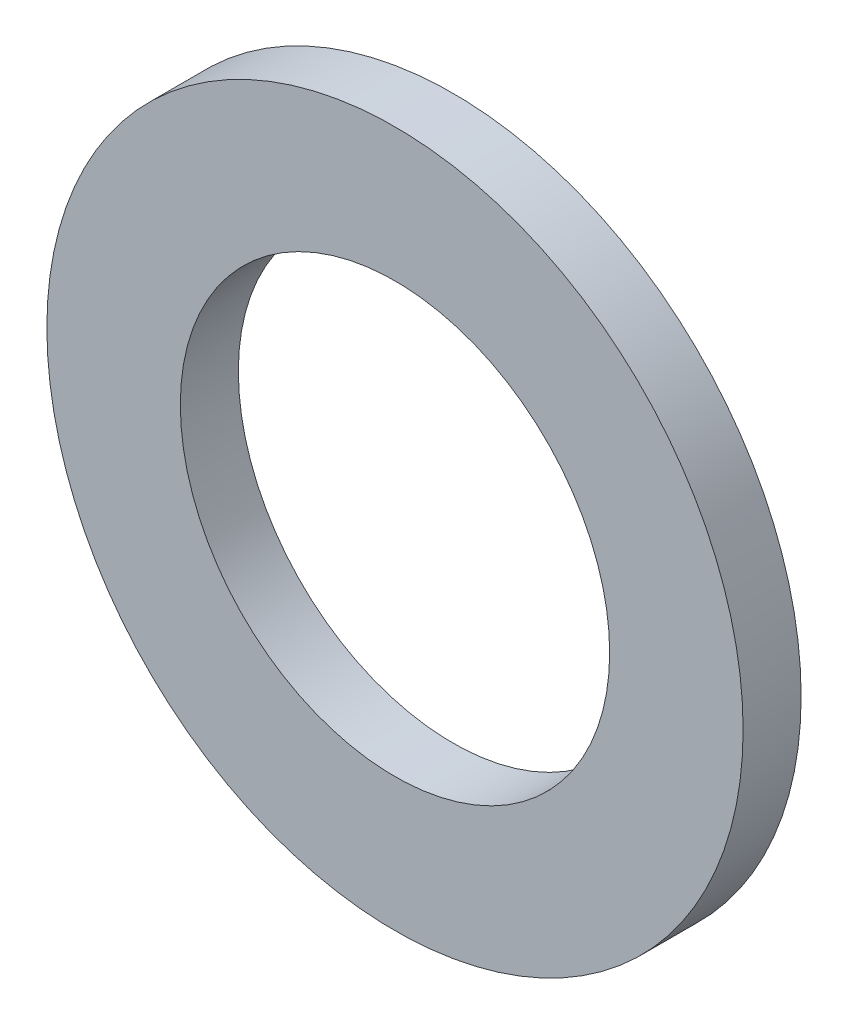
from build123d import *

# Parameters (mm, degrees)
SKETCH1_R           = 38.1
SKETCH1_R_2         = 23.495
BOSS_EXTRUDE1_DEPTH = 6.35


with BuildPart() as part:
    # Sketch1 → Boss-Extrude1 (new body)
    with BuildSketch(Plane.XY):
        Circle(SKETCH1_R)
        Circle(SKETCH1_R_2, mode=Mode.SUBTRACT)
    extrude(amount=BOSS_EXTRUDE1_DEPTH)


solid = part.part
